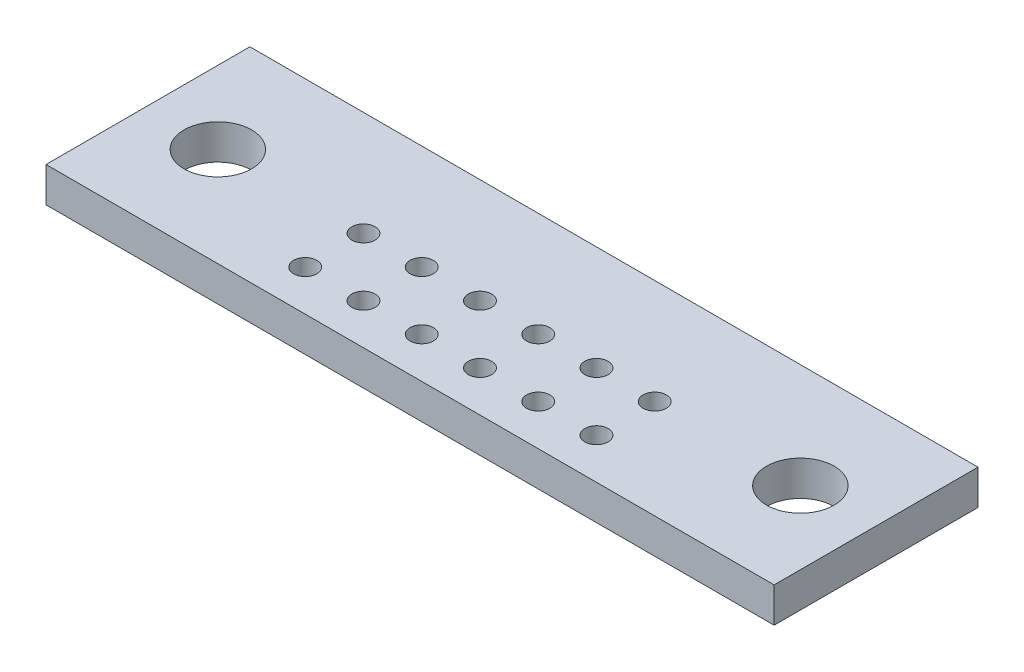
ISO-10303-21;
HEADER;
FILE_DESCRIPTION(('STEP AP214'),'2;1');
FILE_NAME('part.step','',(''),(''),'','','');
FILE_SCHEMA(('AUTOMOTIVE_DESIGN { 1 0 10303 214 1 1 1 1 }'));
ENDSEC;
DATA;
#1=APPLICATION_CONTEXT('core data for automotive mechanical design processes');
#2=APPLICATION_PROTOCOL_DEFINITION('international standard','automotive_design',2000,#1);
#3=PRODUCT_CONTEXT('',#1,'mechanical');
#4=PRODUCT('Part','Part','',(#3));
#5=PRODUCT_RELATED_PRODUCT_CATEGORY('part','',(#4));
#6=PRODUCT_DEFINITION_FORMATION('','',#4);
#7=PRODUCT_DEFINITION_CONTEXT('part definition',#1,'design');
#8=PRODUCT_DEFINITION('design','',#6,#7);
#9=PRODUCT_DEFINITION_SHAPE('','',#8);
#10=(LENGTH_UNIT() NAMED_UNIT(*) SI_UNIT(.MILLI.,.METRE.));
#11=(NAMED_UNIT(*) PLANE_ANGLE_UNIT() SI_UNIT($,.RADIAN.));
#12=(NAMED_UNIT(*) SI_UNIT($,.STERADIAN.) SOLID_ANGLE_UNIT());
#13=UNCERTAINTY_MEASURE_WITH_UNIT(LENGTH_MEASURE(1.E-05),#10,'distance_accuracy_value','');
#14=(GEOMETRIC_REPRESENTATION_CONTEXT(3) GLOBAL_UNCERTAINTY_ASSIGNED_CONTEXT((#13)) GLOBAL_UNIT_ASSIGNED_CONTEXT((#10,
#11,#12)) REPRESENTATION_CONTEXT('',''));
#15=CARTESIAN_POINT('',(0.,0.,0.));
#16=DIRECTION('',(0.,0.,1.));
#17=DIRECTION('',(1.,0.,0.));
#18=AXIS2_PLACEMENT_3D('',#15,#16,#17);
#19=CARTESIAN_POINT('',(0.,1.524,-8.89));
#20=DIRECTION('',(0.,-1.,0.));
#21=DIRECTION('',(0.,0.,-1.));
#22=AXIS2_PLACEMENT_3D('',#19,#20,#21);
#23=PLANE('',#22);
#24=CARTESIAN_POINT('',(28.575,1.524,-4.318));
#25=DIRECTION('',(0.,1.,0.));
#26=DIRECTION('',(0.,0.,1.));
#27=AXIS2_PLACEMENT_3D('',#24,#25,#26);
#28=CIRCLE('',#27,1.4732);
#29=CARTESIAN_POINT('',(28.575,1.524,-5.7912));
#30=VERTEX_POINT('',#29);
#31=EDGE_CURVE('E147',#30,#30,#28,.T.);
#32=ORIENTED_EDGE('',*,*,#31,.F.);
#33=EDGE_LOOP('',(#32));
#34=FACE_BOUND('',#33,.T.);
#35=CARTESIAN_POINT('',(19.685,1.524,-1.778));
#36=DIRECTION('',(0.,1.,0.));
#37=DIRECTION('',(0.,0.,-1.));
#38=AXIS2_PLACEMENT_3D('',#35,#36,#37);
#39=CIRCLE('',#38,0.508000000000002);
#40=CARTESIAN_POINT('',(19.685,1.524,-2.286));
#41=VERTEX_POINT('',#40);
#42=EDGE_CURVE('E161',#41,#41,#39,.T.);
#43=ORIENTED_EDGE('',*,*,#42,.F.);
#44=EDGE_LOOP('',(#43));
#45=FACE_BOUND('',#44,.T.);
#46=CARTESIAN_POINT('',(9.525,1.524,-1.778));
#47=DIRECTION('',(0.,1.,0.));
#48=DIRECTION('',(0.,0.,1.));
#49=AXIS2_PLACEMENT_3D('',#46,#47,#48);
#50=CIRCLE('',#49,0.508000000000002);
#51=CARTESIAN_POINT('',(9.525,1.524,-1.27));
#52=VERTEX_POINT('',#51);
#53=EDGE_CURVE('E171',#52,#52,#50,.T.);
#54=ORIENTED_EDGE('',*,*,#53,.F.);
#55=EDGE_LOOP('',(#54));
#56=FACE_BOUND('',#55,.T.);
#57=CARTESIAN_POINT('',(14.605,1.524,-1.778));
#58=DIRECTION('',(0.,1.,0.));
#59=DIRECTION('',(0.,0.,1.));
#60=AXIS2_PLACEMENT_3D('',#57,#58,#59);
#61=CIRCLE('',#60,0.508000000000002);
#62=CARTESIAN_POINT('',(14.605,1.524,-1.27));
#63=VERTEX_POINT('',#62);
#64=EDGE_CURVE('E181',#63,#63,#61,.T.);
#65=ORIENTED_EDGE('',*,*,#64,.F.);
#66=EDGE_LOOP('',(#65));
#67=FACE_BOUND('',#66,.T.);
#68=CARTESIAN_POINT('',(12.065,1.524,-4.318));
#69=DIRECTION('',(0.,1.,0.));
#70=DIRECTION('',(0.,0.,-1.));
#71=AXIS2_PLACEMENT_3D('',#68,#69,#70);
#72=CIRCLE('',#71,0.508000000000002);
#73=CARTESIAN_POINT('',(12.065,1.524,-4.826));
#74=VERTEX_POINT('',#73);
#75=EDGE_CURVE('E191',#74,#74,#72,.T.);
#76=ORIENTED_EDGE('',*,*,#75,.F.);
#77=EDGE_LOOP('',(#76));
#78=FACE_BOUND('',#77,.T.);
#79=CARTESIAN_POINT('',(22.225,1.524,-4.318));
#80=DIRECTION('',(0.,1.,0.));
#81=DIRECTION('',(0.,0.,1.));
#82=AXIS2_PLACEMENT_3D('',#79,#80,#81);
#83=CIRCLE('',#82,0.508000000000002);
#84=CARTESIAN_POINT('',(22.225,1.524,-3.81));
#85=VERTEX_POINT('',#84);
#86=EDGE_CURVE('E201',#85,#85,#83,.T.);
#87=ORIENTED_EDGE('',*,*,#86,.F.);
#88=EDGE_LOOP('',(#87));
#89=FACE_BOUND('',#88,.T.);
#90=CARTESIAN_POINT('',(17.145,1.524,-4.318));
#91=DIRECTION('',(0.,1.,0.));
#92=DIRECTION('',(0.,0.,1.));
#93=AXIS2_PLACEMENT_3D('',#90,#91,#92);
#94=CIRCLE('',#93,0.508000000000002);
#95=CARTESIAN_POINT('',(17.145,1.524,-3.81));
#96=VERTEX_POINT('',#95);
#97=EDGE_CURVE('E89',#96,#96,#94,.T.);
#98=ORIENTED_EDGE('',*,*,#97,.F.);
#99=EDGE_LOOP('',(#98));
#100=FACE_BOUND('',#99,.T.);
#101=DIRECTION('',(0.,0.,1.));
#102=VECTOR('',#101,1.);
#103=CARTESIAN_POINT('',(0.,1.524,0.));
#104=LINE('',#103,#102);
#105=CARTESIAN_POINT('',(0.,1.524,-8.89));
#106=VERTEX_POINT('',#105);
#107=CARTESIAN_POINT('',(0.,1.524,0.));
#108=VERTEX_POINT('',#107);
#109=EDGE_CURVE('E99',#106,#108,#104,.T.);
#110=ORIENTED_EDGE('',*,*,#109,.T.);
#111=DIRECTION('',(1.,0.,0.));
#112=VECTOR('',#111,1.);
#113=CARTESIAN_POINT('',(0.,1.524,0.));
#114=LINE('',#113,#112);
#115=CARTESIAN_POINT('',(31.75,1.524,0.));
#116=VERTEX_POINT('',#115);
#117=EDGE_CURVE('E84',#108,#116,#114,.T.);
#118=ORIENTED_EDGE('',*,*,#117,.T.);
#119=DIRECTION('',(0.,0.,-1.));
#120=VECTOR('',#119,1.);
#121=CARTESIAN_POINT('',(31.75,1.524,0.));
#122=LINE('',#121,#120);
#123=CARTESIAN_POINT('',(31.75,1.524,-8.89));
#124=VERTEX_POINT('',#123);
#125=EDGE_CURVE('E50',#116,#124,#122,.T.);
#126=ORIENTED_EDGE('',*,*,#125,.T.);
#127=DIRECTION('',(-1.,0.,0.));
#128=VECTOR('',#127,1.);
#129=CARTESIAN_POINT('',(0.,1.524,-8.89));
#130=LINE('',#129,#128);
#131=EDGE_CURVE('E45',#124,#106,#130,.T.);
#132=ORIENTED_EDGE('',*,*,#131,.T.);
#133=EDGE_LOOP('',(#110,#118,#126,#132));
#134=FACE_BOUND('',#133,.T.);
#135=CARTESIAN_POINT('',(19.685,1.524,-4.318));
#136=DIRECTION('',(0.,1.,0.));
#137=DIRECTION('',(0.,0.,1.));
#138=AXIS2_PLACEMENT_3D('',#135,#136,#137);
#139=CIRCLE('',#138,0.508000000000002);
#140=CARTESIAN_POINT('',(19.685,1.524,-3.81));
#141=VERTEX_POINT('',#140);
#142=EDGE_CURVE('E118',#141,#141,#139,.T.);
#143=ORIENTED_EDGE('',*,*,#142,.F.);
#144=EDGE_LOOP('',(#143));
#145=FACE_BOUND('',#144,.T.);
#146=CARTESIAN_POINT('',(9.525,1.524,-4.318));
#147=DIRECTION('',(0.,1.,0.));
#148=DIRECTION('',(0.,0.,-1.));
#149=AXIS2_PLACEMENT_3D('',#146,#147,#148);
#150=CIRCLE('',#149,0.508000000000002);
#151=CARTESIAN_POINT('',(9.525,1.524,-4.826));
#152=VERTEX_POINT('',#151);
#153=EDGE_CURVE('E122',#152,#152,#150,.T.);
#154=ORIENTED_EDGE('',*,*,#153,.F.);
#155=EDGE_LOOP('',(#154));
#156=FACE_BOUND('',#155,.T.);
#157=CARTESIAN_POINT('',(14.605,1.524,-4.318));
#158=DIRECTION('',(0.,1.,0.));
#159=DIRECTION('',(0.,0.,-1.));
#160=AXIS2_PLACEMENT_3D('',#157,#158,#159);
#161=CIRCLE('',#160,0.508000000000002);
#162=CARTESIAN_POINT('',(14.605,1.524,-4.826));
#163=VERTEX_POINT('',#162);
#164=EDGE_CURVE('E126',#163,#163,#161,.T.);
#165=ORIENTED_EDGE('',*,*,#164,.F.);
#166=EDGE_LOOP('',(#165));
#167=FACE_BOUND('',#166,.T.);
#168=CARTESIAN_POINT('',(12.065,1.524,-1.778));
#169=DIRECTION('',(0.,1.,0.));
#170=DIRECTION('',(0.,0.,1.));
#171=AXIS2_PLACEMENT_3D('',#168,#169,#170);
#172=CIRCLE('',#171,0.508000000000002);
#173=CARTESIAN_POINT('',(12.065,1.524,-1.27));
#174=VERTEX_POINT('',#173);
#175=EDGE_CURVE('E130',#174,#174,#172,.T.);
#176=ORIENTED_EDGE('',*,*,#175,.F.);
#177=EDGE_LOOP('',(#176));
#178=FACE_BOUND('',#177,.T.);
#179=CARTESIAN_POINT('',(22.225,1.524,-1.778));
#180=DIRECTION('',(0.,1.,0.));
#181=DIRECTION('',(0.,0.,-1.));
#182=AXIS2_PLACEMENT_3D('',#179,#180,#181);
#183=CIRCLE('',#182,0.508000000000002);
#184=CARTESIAN_POINT('',(22.225,1.524,-2.286));
#185=VERTEX_POINT('',#184);
#186=EDGE_CURVE('E134',#185,#185,#183,.T.);
#187=ORIENTED_EDGE('',*,*,#186,.F.);
#188=EDGE_LOOP('',(#187));
#189=FACE_BOUND('',#188,.T.);
#190=CARTESIAN_POINT('',(17.145,1.524,-1.778));
#191=DIRECTION('',(0.,1.,0.));
#192=DIRECTION('',(0.,0.,-1.));
#193=AXIS2_PLACEMENT_3D('',#190,#191,#192);
#194=CIRCLE('',#193,0.508000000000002);
#195=CARTESIAN_POINT('',(17.145,1.524,-2.286));
#196=VERTEX_POINT('',#195);
#197=EDGE_CURVE('E138',#196,#196,#194,.T.);
#198=ORIENTED_EDGE('',*,*,#197,.F.);
#199=EDGE_LOOP('',(#198));
#200=FACE_BOUND('',#199,.T.);
#201=CARTESIAN_POINT('',(3.175,1.524,-4.318));
#202=DIRECTION('',(0.,1.,0.));
#203=DIRECTION('',(0.,0.,1.));
#204=AXIS2_PLACEMENT_3D('',#201,#202,#203);
#205=CIRCLE('',#204,1.4732);
#206=CARTESIAN_POINT('',(3.175,1.524,-5.7912));
#207=VERTEX_POINT('',#206);
#208=EDGE_CURVE('E141',#207,#207,#205,.T.);
#209=ORIENTED_EDGE('',*,*,#208,.F.);
#210=EDGE_LOOP('',(#209));
#211=FACE_BOUND('',#210,.T.);
#212=ADVANCED_FACE('F30',(#34,#45,#56,#67,#78,#89,#100,#134,#145,#156,#167,#178,#189,#200,#211),
#23,.F.);
#213=CARTESIAN_POINT('',(0.,0.,-8.89));
#214=DIRECTION('',(0.,-1.,0.));
#215=DIRECTION('',(0.,0.,-1.));
#216=AXIS2_PLACEMENT_3D('',#213,#214,#215);
#217=PLANE('',#216);
#218=CARTESIAN_POINT('',(28.575,0.,-4.318));
#219=DIRECTION('',(0.,1.,0.));
#220=DIRECTION('',(0.,0.,1.));
#221=AXIS2_PLACEMENT_3D('',#218,#219,#220);
#222=CIRCLE('',#221,1.4732);
#223=CARTESIAN_POINT('',(28.575,0.,-5.7912));
#224=VERTEX_POINT('',#223);
#225=EDGE_CURVE('E143',#224,#224,#222,.T.);
#226=ORIENTED_EDGE('',*,*,#225,.T.);
#227=EDGE_LOOP('',(#226));
#228=FACE_BOUND('',#227,.T.);
#229=CARTESIAN_POINT('',(19.685,0.,-1.778));
#230=DIRECTION('',(0.,1.,0.));
#231=DIRECTION('',(0.,0.,-1.));
#232=AXIS2_PLACEMENT_3D('',#229,#230,#231);
#233=CIRCLE('',#232,0.508000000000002);
#234=CARTESIAN_POINT('',(19.685,0.,-2.286));
#235=VERTEX_POINT('',#234);
#236=EDGE_CURVE('E158',#235,#235,#233,.T.);
#237=ORIENTED_EDGE('',*,*,#236,.T.);
#238=EDGE_LOOP('',(#237));
#239=FACE_BOUND('',#238,.T.);
#240=CARTESIAN_POINT('',(9.525,0.,-1.778));
#241=DIRECTION('',(0.,1.,0.));
#242=DIRECTION('',(0.,0.,1.));
#243=AXIS2_PLACEMENT_3D('',#240,#241,#242);
#244=CIRCLE('',#243,0.508000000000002);
#245=CARTESIAN_POINT('',(9.525,0.,-1.27));
#246=VERTEX_POINT('',#245);
#247=EDGE_CURVE('E168',#246,#246,#244,.T.);
#248=ORIENTED_EDGE('',*,*,#247,.T.);
#249=EDGE_LOOP('',(#248));
#250=FACE_BOUND('',#249,.T.);
#251=CARTESIAN_POINT('',(14.605,0.,-1.778));
#252=DIRECTION('',(0.,1.,0.));
#253=DIRECTION('',(0.,0.,1.));
#254=AXIS2_PLACEMENT_3D('',#251,#252,#253);
#255=CIRCLE('',#254,0.508000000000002);
#256=CARTESIAN_POINT('',(14.605,0.,-1.27));
#257=VERTEX_POINT('',#256);
#258=EDGE_CURVE('E178',#257,#257,#255,.T.);
#259=ORIENTED_EDGE('',*,*,#258,.T.);
#260=EDGE_LOOP('',(#259));
#261=FACE_BOUND('',#260,.T.);
#262=CARTESIAN_POINT('',(12.065,0.,-4.318));
#263=DIRECTION('',(0.,1.,0.));
#264=DIRECTION('',(0.,0.,-1.));
#265=AXIS2_PLACEMENT_3D('',#262,#263,#264);
#266=CIRCLE('',#265,0.508000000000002);
#267=CARTESIAN_POINT('',(12.065,0.,-4.826));
#268=VERTEX_POINT('',#267);
#269=EDGE_CURVE('E188',#268,#268,#266,.T.);
#270=ORIENTED_EDGE('',*,*,#269,.T.);
#271=EDGE_LOOP('',(#270));
#272=FACE_BOUND('',#271,.T.);
#273=CARTESIAN_POINT('',(22.225,0.,-4.318));
#274=DIRECTION('',(0.,1.,0.));
#275=DIRECTION('',(0.,0.,1.));
#276=AXIS2_PLACEMENT_3D('',#273,#274,#275);
#277=CIRCLE('',#276,0.508000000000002);
#278=CARTESIAN_POINT('',(22.225,0.,-3.81));
#279=VERTEX_POINT('',#278);
#280=EDGE_CURVE('E198',#279,#279,#277,.T.);
#281=ORIENTED_EDGE('',*,*,#280,.T.);
#282=EDGE_LOOP('',(#281));
#283=FACE_BOUND('',#282,.T.);
#284=CARTESIAN_POINT('',(17.145,0.,-4.318));
#285=DIRECTION('',(0.,1.,0.));
#286=DIRECTION('',(0.,0.,1.));
#287=AXIS2_PLACEMENT_3D('',#284,#285,#286);
#288=CIRCLE('',#287,0.508000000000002);
#289=CARTESIAN_POINT('',(17.145,0.,-3.81));
#290=VERTEX_POINT('',#289);
#291=EDGE_CURVE('E92',#290,#290,#288,.T.);
#292=ORIENTED_EDGE('',*,*,#291,.T.);
#293=EDGE_LOOP('',(#292));
#294=FACE_BOUND('',#293,.T.);
#295=DIRECTION('',(0.,0.,1.));
#296=VECTOR('',#295,1.);
#297=CARTESIAN_POINT('',(0.,0.,0.));
#298=LINE('',#297,#296);
#299=CARTESIAN_POINT('',(0.,0.,-8.89));
#300=VERTEX_POINT('',#299);
#301=CARTESIAN_POINT('',(0.,0.,0.));
#302=VERTEX_POINT('',#301);
#303=EDGE_CURVE('E76',#300,#302,#298,.T.);
#304=ORIENTED_EDGE('',*,*,#303,.F.);
#305=DIRECTION('',(-1.,0.,0.));
#306=VECTOR('',#305,1.);
#307=CARTESIAN_POINT('',(0.,0.,-8.89));
#308=LINE('',#307,#306);
#309=CARTESIAN_POINT('',(31.75,0.,-8.89));
#310=VERTEX_POINT('',#309);
#311=EDGE_CURVE('E97',#310,#300,#308,.T.);
#312=ORIENTED_EDGE('',*,*,#311,.F.);
#313=DIRECTION('',(0.,0.,-1.));
#314=VECTOR('',#313,1.);
#315=CARTESIAN_POINT('',(31.75,0.,0.));
#316=LINE('',#315,#314);
#317=CARTESIAN_POINT('',(31.75,0.,0.));
#318=VERTEX_POINT('',#317);
#319=EDGE_CURVE('E77',#318,#310,#316,.T.);
#320=ORIENTED_EDGE('',*,*,#319,.F.);
#321=DIRECTION('',(1.,0.,0.));
#322=VECTOR('',#321,1.);
#323=CARTESIAN_POINT('',(0.,0.,0.));
#324=LINE('',#323,#322);
#325=EDGE_CURVE('E71',#302,#318,#324,.T.);
#326=ORIENTED_EDGE('',*,*,#325,.F.);
#327=EDGE_LOOP('',(#304,#312,#320,#326));
#328=FACE_BOUND('',#327,.T.);
#329=CARTESIAN_POINT('',(19.685,0.,-4.318));
#330=DIRECTION('',(0.,1.,0.));
#331=DIRECTION('',(0.,0.,1.));
#332=AXIS2_PLACEMENT_3D('',#329,#330,#331);
#333=CIRCLE('',#332,0.508000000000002);
#334=CARTESIAN_POINT('',(19.685,0.,-3.81));
#335=VERTEX_POINT('',#334);
#336=EDGE_CURVE('E204',#335,#335,#333,.T.);
#337=ORIENTED_EDGE('',*,*,#336,.T.);
#338=EDGE_LOOP('',(#337));
#339=FACE_BOUND('',#338,.T.);
#340=CARTESIAN_POINT('',(9.525,0.,-4.318));
#341=DIRECTION('',(0.,1.,0.));
#342=DIRECTION('',(0.,0.,-1.));
#343=AXIS2_PLACEMENT_3D('',#340,#341,#342);
#344=CIRCLE('',#343,0.508000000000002);
#345=CARTESIAN_POINT('',(9.525,0.,-4.826));
#346=VERTEX_POINT('',#345);
#347=EDGE_CURVE('E194',#346,#346,#344,.T.);
#348=ORIENTED_EDGE('',*,*,#347,.T.);
#349=EDGE_LOOP('',(#348));
#350=FACE_BOUND('',#349,.T.);
#351=CARTESIAN_POINT('',(14.605,0.,-4.318));
#352=DIRECTION('',(0.,1.,0.));
#353=DIRECTION('',(0.,0.,-1.));
#354=AXIS2_PLACEMENT_3D('',#351,#352,#353);
#355=CIRCLE('',#354,0.508000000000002);
#356=CARTESIAN_POINT('',(14.605,0.,-4.826));
#357=VERTEX_POINT('',#356);
#358=EDGE_CURVE('E184',#357,#357,#355,.T.);
#359=ORIENTED_EDGE('',*,*,#358,.T.);
#360=EDGE_LOOP('',(#359));
#361=FACE_BOUND('',#360,.T.);
#362=CARTESIAN_POINT('',(12.065,0.,-1.778));
#363=DIRECTION('',(0.,1.,0.));
#364=DIRECTION('',(0.,0.,1.));
#365=AXIS2_PLACEMENT_3D('',#362,#363,#364);
#366=CIRCLE('',#365,0.508000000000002);
#367=CARTESIAN_POINT('',(12.065,0.,-1.27));
#368=VERTEX_POINT('',#367);
#369=EDGE_CURVE('E174',#368,#368,#366,.T.);
#370=ORIENTED_EDGE('',*,*,#369,.T.);
#371=EDGE_LOOP('',(#370));
#372=FACE_BOUND('',#371,.T.);
#373=CARTESIAN_POINT('',(22.225,0.,-1.778));
#374=DIRECTION('',(0.,1.,0.));
#375=DIRECTION('',(0.,0.,-1.));
#376=AXIS2_PLACEMENT_3D('',#373,#374,#375);
#377=CIRCLE('',#376,0.508000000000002);
#378=CARTESIAN_POINT('',(22.225,0.,-2.286));
#379=VERTEX_POINT('',#378);
#380=EDGE_CURVE('E164',#379,#379,#377,.T.);
#381=ORIENTED_EDGE('',*,*,#380,.T.);
#382=EDGE_LOOP('',(#381));
#383=FACE_BOUND('',#382,.T.);
#384=CARTESIAN_POINT('',(17.145,0.,-1.778));
#385=DIRECTION('',(0.,1.,0.));
#386=DIRECTION('',(0.,0.,-1.));
#387=AXIS2_PLACEMENT_3D('',#384,#385,#386);
#388=CIRCLE('',#387,0.508000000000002);
#389=CARTESIAN_POINT('',(17.145,0.,-2.286));
#390=VERTEX_POINT('',#389);
#391=EDGE_CURVE('E154',#390,#390,#388,.T.);
#392=ORIENTED_EDGE('',*,*,#391,.T.);
#393=EDGE_LOOP('',(#392));
#394=FACE_BOUND('',#393,.T.);
#395=CARTESIAN_POINT('',(3.175,0.,-4.318));
#396=DIRECTION('',(0.,1.,0.));
#397=DIRECTION('',(0.,0.,1.));
#398=AXIS2_PLACEMENT_3D('',#395,#396,#397);
#399=CIRCLE('',#398,1.4732);
#400=CARTESIAN_POINT('',(3.175,0.,-5.7912));
#401=VERTEX_POINT('',#400);
#402=EDGE_CURVE('E144',#401,#401,#399,.T.);
#403=ORIENTED_EDGE('',*,*,#402,.T.);
#404=EDGE_LOOP('',(#403));
#405=FACE_BOUND('',#404,.T.);
#406=ADVANCED_FACE('F72',(#228,#239,#250,#261,#272,#283,#294,#328,#339,#350,#361,#372,#383,#394,
#405),#217,.T.);
#407=CARTESIAN_POINT('',(0.,1.524,0.));
#408=DIRECTION('',(1.,0.,0.));
#409=DIRECTION('',(0.,0.,-1.));
#410=AXIS2_PLACEMENT_3D('',#407,#408,#409);
#411=PLANE('',#410);
#412=ORIENTED_EDGE('',*,*,#303,.T.);
#413=DIRECTION('',(0.,-1.,0.));
#414=VECTOR('',#413,1.);
#415=CARTESIAN_POINT('',(0.,1.524,0.));
#416=LINE('',#415,#414);
#417=EDGE_CURVE('E11',#108,#302,#416,.T.);
#418=ORIENTED_EDGE('',*,*,#417,.F.);
#419=ORIENTED_EDGE('',*,*,#109,.F.);
#420=DIRECTION('',(0.,-1.,0.));
#421=VECTOR('',#420,1.);
#422=CARTESIAN_POINT('',(0.,1.524,-8.89));
#423=LINE('',#422,#421);
#424=EDGE_CURVE('E88',#106,#300,#423,.T.);
#425=ORIENTED_EDGE('',*,*,#424,.T.);
#426=EDGE_LOOP('',(#412,#418,#419,#425));
#427=FACE_BOUND('',#426,.T.);
#428=ADVANCED_FACE('F32',(#427),#411,.F.);
#429=CARTESIAN_POINT('',(0.,1.524,0.));
#430=DIRECTION('',(0.,0.,-1.));
#431=DIRECTION('',(-1.,0.,0.));
#432=AXIS2_PLACEMENT_3D('',#429,#430,#431);
#433=PLANE('',#432);
#434=ORIENTED_EDGE('',*,*,#325,.T.);
#435=DIRECTION('',(0.,-1.,0.));
#436=VECTOR('',#435,1.);
#437=CARTESIAN_POINT('',(31.75,1.524,0.));
#438=LINE('',#437,#436);
#439=EDGE_CURVE('E38',#116,#318,#438,.T.);
#440=ORIENTED_EDGE('',*,*,#439,.F.);
#441=ORIENTED_EDGE('',*,*,#117,.F.);
#442=ORIENTED_EDGE('',*,*,#417,.T.);
#443=EDGE_LOOP('',(#434,#440,#441,#442));
#444=FACE_BOUND('',#443,.T.);
#445=ADVANCED_FACE('F83',(#444),#433,.F.);
#446=CARTESIAN_POINT('',(31.75,1.524,0.));
#447=DIRECTION('',(-1.,0.,0.));
#448=DIRECTION('',(0.,0.,1.));
#449=AXIS2_PLACEMENT_3D('',#446,#447,#448);
#450=PLANE('',#449);
#451=ORIENTED_EDGE('',*,*,#319,.T.);
#452=DIRECTION('',(0.,-1.,0.));
#453=VECTOR('',#452,1.);
#454=CARTESIAN_POINT('',(31.75,1.524,-8.89));
#455=LINE('',#454,#453);
#456=EDGE_CURVE('E105',#124,#310,#455,.T.);
#457=ORIENTED_EDGE('',*,*,#456,.F.);
#458=ORIENTED_EDGE('',*,*,#125,.F.);
#459=ORIENTED_EDGE('',*,*,#439,.T.);
#460=EDGE_LOOP('',(#451,#457,#458,#459));
#461=FACE_BOUND('',#460,.T.);
#462=ADVANCED_FACE('F108',(#461),#450,.F.);
#463=CARTESIAN_POINT('',(0.,1.524,-8.89));
#464=DIRECTION('',(0.,0.,1.));
#465=DIRECTION('',(1.,0.,0.));
#466=AXIS2_PLACEMENT_3D('',#463,#464,#465);
#467=PLANE('',#466);
#468=ORIENTED_EDGE('',*,*,#311,.T.);
#469=ORIENTED_EDGE('',*,*,#424,.F.);
#470=ORIENTED_EDGE('',*,*,#131,.F.);
#471=ORIENTED_EDGE('',*,*,#456,.T.);
#472=EDGE_LOOP('',(#468,#469,#470,#471));
#473=FACE_BOUND('',#472,.T.);
#474=ADVANCED_FACE('F110',(#473),#467,.F.);
#475=CARTESIAN_POINT('',(17.145,1.524,-4.318));
#476=DIRECTION('',(0.,-1.,0.));
#477=DIRECTION('',(0.,0.,-1.));
#478=AXIS2_PLACEMENT_3D('',#475,#476,#477);
#479=CYLINDRICAL_SURFACE('',#478,0.508000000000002);
#480=ORIENTED_EDGE('',*,*,#97,.T.);
#481=EDGE_LOOP('',(#480));
#482=FACE_BOUND('',#481,.T.);
#483=ORIENTED_EDGE('',*,*,#291,.F.);
#484=EDGE_LOOP('',(#483));
#485=FACE_BOUND('',#484,.T.);
#486=ADVANCED_FACE('F211',(#482,#485),#479,.F.);
#487=CARTESIAN_POINT('',(19.685,1.524,-4.318));
#488=DIRECTION('',(0.,-1.,0.));
#489=DIRECTION('',(0.,0.,-1.));
#490=AXIS2_PLACEMENT_3D('',#487,#488,#489);
#491=CYLINDRICAL_SURFACE('',#490,0.508000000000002);
#492=ORIENTED_EDGE('',*,*,#142,.T.);
#493=EDGE_LOOP('',(#492));
#494=FACE_BOUND('',#493,.T.);
#495=ORIENTED_EDGE('',*,*,#336,.F.);
#496=EDGE_LOOP('',(#495));
#497=FACE_BOUND('',#496,.T.);
#498=ADVANCED_FACE('F213',(#494,#497),#491,.F.);
#499=CARTESIAN_POINT('',(22.225,1.524,-4.318));
#500=DIRECTION('',(0.,-1.,0.));
#501=DIRECTION('',(0.,0.,-1.));
#502=AXIS2_PLACEMENT_3D('',#499,#500,#501);
#503=CYLINDRICAL_SURFACE('',#502,0.508000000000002);
#504=ORIENTED_EDGE('',*,*,#86,.T.);
#505=EDGE_LOOP('',(#504));
#506=FACE_BOUND('',#505,.T.);
#507=ORIENTED_EDGE('',*,*,#280,.F.);
#508=EDGE_LOOP('',(#507));
#509=FACE_BOUND('',#508,.T.);
#510=ADVANCED_FACE('F220',(#506,#509),#503,.F.);
#511=CARTESIAN_POINT('',(9.525,1.524,-4.318));
#512=DIRECTION('',(0.,-1.,0.));
#513=DIRECTION('',(0.,0.,-1.));
#514=AXIS2_PLACEMENT_3D('',#511,#512,#513);
#515=CYLINDRICAL_SURFACE('',#514,0.508000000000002);
#516=ORIENTED_EDGE('',*,*,#153,.T.);
#517=EDGE_LOOP('',(#516));
#518=FACE_BOUND('',#517,.T.);
#519=ORIENTED_EDGE('',*,*,#347,.F.);
#520=EDGE_LOOP('',(#519));
#521=FACE_BOUND('',#520,.T.);
#522=ADVANCED_FACE('F281',(#518,#521),#515,.F.);
#523=CARTESIAN_POINT('',(12.065,1.524,-4.318));
#524=DIRECTION('',(0.,-1.,0.));
#525=DIRECTION('',(0.,0.,-1.));
#526=AXIS2_PLACEMENT_3D('',#523,#524,#525);
#527=CYLINDRICAL_SURFACE('',#526,0.508000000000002);
#528=ORIENTED_EDGE('',*,*,#75,.T.);
#529=EDGE_LOOP('',(#528));
#530=FACE_BOUND('',#529,.T.);
#531=ORIENTED_EDGE('',*,*,#269,.F.);
#532=EDGE_LOOP('',(#531));
#533=FACE_BOUND('',#532,.T.);
#534=ADVANCED_FACE('F289',(#530,#533),#527,.F.);
#535=CARTESIAN_POINT('',(14.605,1.524,-4.318));
#536=DIRECTION('',(0.,-1.,0.));
#537=DIRECTION('',(0.,0.,-1.));
#538=AXIS2_PLACEMENT_3D('',#535,#536,#537);
#539=CYLINDRICAL_SURFACE('',#538,0.508000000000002);
#540=ORIENTED_EDGE('',*,*,#164,.T.);
#541=EDGE_LOOP('',(#540));
#542=FACE_BOUND('',#541,.T.);
#543=ORIENTED_EDGE('',*,*,#358,.F.);
#544=EDGE_LOOP('',(#543));
#545=FACE_BOUND('',#544,.T.);
#546=ADVANCED_FACE('F298',(#542,#545),#539,.F.);
#547=CARTESIAN_POINT('',(14.605,1.524,-1.778));
#548=DIRECTION('',(0.,-1.,0.));
#549=DIRECTION('',(0.,0.,-1.));
#550=AXIS2_PLACEMENT_3D('',#547,#548,#549);
#551=CYLINDRICAL_SURFACE('',#550,0.508000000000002);
#552=ORIENTED_EDGE('',*,*,#64,.T.);
#553=EDGE_LOOP('',(#552));
#554=FACE_BOUND('',#553,.T.);
#555=ORIENTED_EDGE('',*,*,#258,.F.);
#556=EDGE_LOOP('',(#555));
#557=FACE_BOUND('',#556,.T.);
#558=ADVANCED_FACE('F307',(#554,#557),#551,.F.);
#559=CARTESIAN_POINT('',(12.065,1.524,-1.778));
#560=DIRECTION('',(0.,-1.,0.));
#561=DIRECTION('',(0.,0.,-1.));
#562=AXIS2_PLACEMENT_3D('',#559,#560,#561);
#563=CYLINDRICAL_SURFACE('',#562,0.508000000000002);
#564=ORIENTED_EDGE('',*,*,#175,.T.);
#565=EDGE_LOOP('',(#564));
#566=FACE_BOUND('',#565,.T.);
#567=ORIENTED_EDGE('',*,*,#369,.F.);
#568=EDGE_LOOP('',(#567));
#569=FACE_BOUND('',#568,.T.);
#570=ADVANCED_FACE('F316',(#566,#569),#563,.F.);
#571=CARTESIAN_POINT('',(9.525,1.524,-1.778));
#572=DIRECTION('',(0.,-1.,0.));
#573=DIRECTION('',(0.,0.,-1.));
#574=AXIS2_PLACEMENT_3D('',#571,#572,#573);
#575=CYLINDRICAL_SURFACE('',#574,0.508000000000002);
#576=ORIENTED_EDGE('',*,*,#53,.T.);
#577=EDGE_LOOP('',(#576));
#578=FACE_BOUND('',#577,.T.);
#579=ORIENTED_EDGE('',*,*,#247,.F.);
#580=EDGE_LOOP('',(#579));
#581=FACE_BOUND('',#580,.T.);
#582=ADVANCED_FACE('F325',(#578,#581),#575,.F.);
#583=CARTESIAN_POINT('',(22.225,1.524,-1.778));
#584=DIRECTION('',(0.,-1.,0.));
#585=DIRECTION('',(0.,0.,-1.));
#586=AXIS2_PLACEMENT_3D('',#583,#584,#585);
#587=CYLINDRICAL_SURFACE('',#586,0.508000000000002);
#588=ORIENTED_EDGE('',*,*,#186,.T.);
#589=EDGE_LOOP('',(#588));
#590=FACE_BOUND('',#589,.T.);
#591=ORIENTED_EDGE('',*,*,#380,.F.);
#592=EDGE_LOOP('',(#591));
#593=FACE_BOUND('',#592,.T.);
#594=ADVANCED_FACE('F334',(#590,#593),#587,.F.);
#595=CARTESIAN_POINT('',(19.685,1.524,-1.778));
#596=DIRECTION('',(0.,-1.,0.));
#597=DIRECTION('',(0.,0.,-1.));
#598=AXIS2_PLACEMENT_3D('',#595,#596,#597);
#599=CYLINDRICAL_SURFACE('',#598,0.508000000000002);
#600=ORIENTED_EDGE('',*,*,#42,.T.);
#601=EDGE_LOOP('',(#600));
#602=FACE_BOUND('',#601,.T.);
#603=ORIENTED_EDGE('',*,*,#236,.F.);
#604=EDGE_LOOP('',(#603));
#605=FACE_BOUND('',#604,.T.);
#606=ADVANCED_FACE('F343',(#602,#605),#599,.F.);
#607=CARTESIAN_POINT('',(17.145,1.524,-1.778));
#608=DIRECTION('',(0.,-1.,0.));
#609=DIRECTION('',(0.,0.,-1.));
#610=AXIS2_PLACEMENT_3D('',#607,#608,#609);
#611=CYLINDRICAL_SURFACE('',#610,0.508000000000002);
#612=ORIENTED_EDGE('',*,*,#197,.T.);
#613=EDGE_LOOP('',(#612));
#614=FACE_BOUND('',#613,.T.);
#615=ORIENTED_EDGE('',*,*,#391,.F.);
#616=EDGE_LOOP('',(#615));
#617=FACE_BOUND('',#616,.T.);
#618=ADVANCED_FACE('F352',(#614,#617),#611,.F.);
#619=CARTESIAN_POINT('',(28.575,1.524,-4.318));
#620=DIRECTION('',(0.,-1.,0.));
#621=DIRECTION('',(0.,0.,-1.));
#622=AXIS2_PLACEMENT_3D('',#619,#620,#621);
#623=CYLINDRICAL_SURFACE('',#622,1.4732);
#624=CARTESIAN_POINT('',(28.575,1.524,-5.7912));
#625=CARTESIAN_POINT('',(28.575,1.508125,-5.7912));
#626=CARTESIAN_POINT('',(28.575,1.49225,-5.7912));
#627=CARTESIAN_POINT('',(28.575,1.4605,-5.7912));
#628=CARTESIAN_POINT('',(28.575,1.444625,-5.7912));
#629=CARTESIAN_POINT('',(28.575,1.412875,-5.7912));
#630=CARTESIAN_POINT('',(28.575,1.397,-5.7912));
#631=CARTESIAN_POINT('',(28.575,1.36525,-5.7912));
#632=CARTESIAN_POINT('',(28.575,1.349375,-5.7912));
#633=CARTESIAN_POINT('',(28.575,1.317625,-5.7912));
#634=CARTESIAN_POINT('',(28.575,1.30175,-5.7912));
#635=CARTESIAN_POINT('',(28.575,1.27,-5.7912));
#636=CARTESIAN_POINT('',(28.575,1.254125,-5.7912));
#637=CARTESIAN_POINT('',(28.575,1.222375,-5.7912));
#638=CARTESIAN_POINT('',(28.575,1.2065,-5.7912));
#639=CARTESIAN_POINT('',(28.575,1.17475,-5.7912));
#640=CARTESIAN_POINT('',(28.575,1.158875,-5.7912));
#641=CARTESIAN_POINT('',(28.575,1.127125,-5.7912));
#642=CARTESIAN_POINT('',(28.575,1.11125,-5.7912));
#643=CARTESIAN_POINT('',(28.575,1.0795,-5.7912));
#644=CARTESIAN_POINT('',(28.575,1.063625,-5.7912));
#645=CARTESIAN_POINT('',(28.575,1.031875,-5.7912));
#646=CARTESIAN_POINT('',(28.575,1.016,-5.7912));
#647=CARTESIAN_POINT('',(28.575,0.98425,-5.7912));
#648=CARTESIAN_POINT('',(28.575,0.968375,-5.7912));
#649=CARTESIAN_POINT('',(28.575,0.936625,-5.7912));
#650=CARTESIAN_POINT('',(28.575,0.92075,-5.7912));
#651=CARTESIAN_POINT('',(28.575,0.889,-5.7912));
#652=CARTESIAN_POINT('',(28.575,0.873125,-5.7912));
#653=CARTESIAN_POINT('',(28.575,0.841375,-5.7912));
#654=CARTESIAN_POINT('',(28.575,0.8255,-5.7912));
#655=CARTESIAN_POINT('',(28.575,0.79375,-5.7912));
#656=CARTESIAN_POINT('',(28.575,0.777875,-5.7912));
#657=CARTESIAN_POINT('',(28.575,0.746125,-5.7912));
#658=CARTESIAN_POINT('',(28.575,0.73025,-5.7912));
#659=CARTESIAN_POINT('',(28.575,0.6985,-5.7912));
#660=CARTESIAN_POINT('',(28.575,0.682625,-5.7912));
#661=CARTESIAN_POINT('',(28.575,0.650875,-5.7912));
#662=CARTESIAN_POINT('',(28.575,0.635,-5.7912));
#663=CARTESIAN_POINT('',(28.575,0.60325,-5.7912));
#664=CARTESIAN_POINT('',(28.575,0.587375,-5.7912));
#665=CARTESIAN_POINT('',(28.575,0.555625,-5.7912));
#666=CARTESIAN_POINT('',(28.575,0.53975,-5.7912));
#667=CARTESIAN_POINT('',(28.575,0.508,-5.7912));
#668=CARTESIAN_POINT('',(28.575,0.492125,-5.7912));
#669=CARTESIAN_POINT('',(28.575,0.460375,-5.7912));
#670=CARTESIAN_POINT('',(28.575,0.4445,-5.7912));
#671=CARTESIAN_POINT('',(28.575,0.41275,-5.7912));
#672=CARTESIAN_POINT('',(28.575,0.396875,-5.7912));
#673=CARTESIAN_POINT('',(28.575,0.365125,-5.7912));
#674=CARTESIAN_POINT('',(28.575,0.34925,-5.7912));
#675=CARTESIAN_POINT('',(28.575,0.3175,-5.7912));
#676=CARTESIAN_POINT('',(28.575,0.301625,-5.7912));
#677=CARTESIAN_POINT('',(28.575,0.269875,-5.7912));
#678=CARTESIAN_POINT('',(28.575,0.254,-5.7912));
#679=CARTESIAN_POINT('',(28.575,0.22225,-5.7912));
#680=CARTESIAN_POINT('',(28.575,0.206375,-5.7912));
#681=CARTESIAN_POINT('',(28.575,0.174625,-5.7912));
#682=CARTESIAN_POINT('',(28.575,0.15875,-5.7912));
#683=CARTESIAN_POINT('',(28.575,0.127,-5.7912));
#684=CARTESIAN_POINT('',(28.575,0.111125,-5.7912));
#685=CARTESIAN_POINT('',(28.575,0.079375,-5.7912));
#686=CARTESIAN_POINT('',(28.575,0.0635,-5.7912));
#687=CARTESIAN_POINT('',(28.575,0.0317499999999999,-5.7912));
#688=CARTESIAN_POINT('',(28.575,0.015875,-5.7912));
#689=CARTESIAN_POINT('',(28.575,0.,-5.7912));
#690=B_SPLINE_CURVE_WITH_KNOTS('',3,(#624,#625,#626,#627,#628,#629,#630,#631,#632,#633,#634,
#635,#636,#637,#638,#639,#640,#641,#642,#643,#644,#645,#646,#647,#648,#649,#650,#651,#652,#653,
#654,#655,#656,#657,#658,#659,#660,#661,#662,#663,#664,#665,#666,#667,#668,#669,#670,#671,#672,
#673,#674,#675,#676,#677,#678,#679,#680,#681,#682,#683,#684,#685,#686,#687,#688,#689),
.UNSPECIFIED.,.F.,.F.,(4,2,2,2,2,2,2,2,2,2,2,2,2,2,2,2,2,2,2,2,2,2,2,2,2,2,2,2,2,2,2,2,4),(0.,
0.0476250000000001,0.0952500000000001,0.142875,0.1905,0.238125,0.28575,0.333375,0.381,0.428625,
0.47625,0.523875,0.5715,0.619125,0.66675,0.714375,0.762,0.809625,0.85725,0.904875,0.9525,
1.000125,1.04775,1.095375,1.143,1.190625,1.23825,1.285875,1.3335,1.381125,1.42875,1.476375,
1.524),.UNSPECIFIED.);
#691=EDGE_CURVE('BSEAM361',#30,#224,#690,.T.);
#692=ORIENTED_EDGE('',*,*,#31,.T.);
#693=ORIENTED_EDGE('',*,*,#225,.F.);
#694=ORIENTED_EDGE('',*,*,#691,.T.);
#695=ORIENTED_EDGE('',*,*,#691,.F.);
#696=EDGE_LOOP('',(#692,#694,#693,#695));
#697=FACE_BOUND('',#696,.T.);
#698=ADVANCED_FACE('F361',(#697),#623,.F.);
#699=CARTESIAN_POINT('',(3.175,1.524,-4.318));
#700=DIRECTION('',(0.,-1.,0.));
#701=DIRECTION('',(0.,0.,-1.));
#702=AXIS2_PLACEMENT_3D('',#699,#700,#701);
#703=CYLINDRICAL_SURFACE('',#702,1.4732);
#704=CARTESIAN_POINT('',(3.175,1.524,-5.7912));
#705=CARTESIAN_POINT('',(3.175,1.508125,-5.7912));
#706=CARTESIAN_POINT('',(3.175,1.49225,-5.7912));
#707=CARTESIAN_POINT('',(3.175,1.4605,-5.7912));
#708=CARTESIAN_POINT('',(3.175,1.444625,-5.7912));
#709=CARTESIAN_POINT('',(3.175,1.412875,-5.7912));
#710=CARTESIAN_POINT('',(3.175,1.397,-5.7912));
#711=CARTESIAN_POINT('',(3.175,1.36525,-5.7912));
#712=CARTESIAN_POINT('',(3.175,1.349375,-5.7912));
#713=CARTESIAN_POINT('',(3.175,1.317625,-5.7912));
#714=CARTESIAN_POINT('',(3.175,1.30175,-5.7912));
#715=CARTESIAN_POINT('',(3.175,1.27,-5.7912));
#716=CARTESIAN_POINT('',(3.175,1.254125,-5.7912));
#717=CARTESIAN_POINT('',(3.175,1.222375,-5.7912));
#718=CARTESIAN_POINT('',(3.175,1.2065,-5.7912));
#719=CARTESIAN_POINT('',(3.175,1.17475,-5.7912));
#720=CARTESIAN_POINT('',(3.175,1.158875,-5.7912));
#721=CARTESIAN_POINT('',(3.175,1.127125,-5.7912));
#722=CARTESIAN_POINT('',(3.175,1.11125,-5.7912));
#723=CARTESIAN_POINT('',(3.175,1.0795,-5.7912));
#724=CARTESIAN_POINT('',(3.175,1.063625,-5.7912));
#725=CARTESIAN_POINT('',(3.175,1.031875,-5.7912));
#726=CARTESIAN_POINT('',(3.175,1.016,-5.7912));
#727=CARTESIAN_POINT('',(3.175,0.98425,-5.7912));
#728=CARTESIAN_POINT('',(3.175,0.968375,-5.7912));
#729=CARTESIAN_POINT('',(3.175,0.936625,-5.7912));
#730=CARTESIAN_POINT('',(3.175,0.92075,-5.7912));
#731=CARTESIAN_POINT('',(3.175,0.889,-5.7912));
#732=CARTESIAN_POINT('',(3.175,0.873125,-5.7912));
#733=CARTESIAN_POINT('',(3.175,0.841375,-5.7912));
#734=CARTESIAN_POINT('',(3.175,0.8255,-5.7912));
#735=CARTESIAN_POINT('',(3.175,0.79375,-5.7912));
#736=CARTESIAN_POINT('',(3.175,0.777875,-5.7912));
#737=CARTESIAN_POINT('',(3.175,0.746125,-5.7912));
#738=CARTESIAN_POINT('',(3.175,0.73025,-5.7912));
#739=CARTESIAN_POINT('',(3.175,0.6985,-5.7912));
#740=CARTESIAN_POINT('',(3.175,0.682625,-5.7912));
#741=CARTESIAN_POINT('',(3.175,0.650875,-5.7912));
#742=CARTESIAN_POINT('',(3.175,0.635,-5.7912));
#743=CARTESIAN_POINT('',(3.175,0.60325,-5.7912));
#744=CARTESIAN_POINT('',(3.175,0.587375,-5.7912));
#745=CARTESIAN_POINT('',(3.175,0.555625,-5.7912));
#746=CARTESIAN_POINT('',(3.175,0.53975,-5.7912));
#747=CARTESIAN_POINT('',(3.175,0.508,-5.7912));
#748=CARTESIAN_POINT('',(3.175,0.492125,-5.7912));
#749=CARTESIAN_POINT('',(3.175,0.460375,-5.7912));
#750=CARTESIAN_POINT('',(3.175,0.4445,-5.7912));
#751=CARTESIAN_POINT('',(3.175,0.41275,-5.7912));
#752=CARTESIAN_POINT('',(3.175,0.396875,-5.7912));
#753=CARTESIAN_POINT('',(3.175,0.365125,-5.7912));
#754=CARTESIAN_POINT('',(3.175,0.34925,-5.7912));
#755=CARTESIAN_POINT('',(3.175,0.3175,-5.7912));
#756=CARTESIAN_POINT('',(3.175,0.301625,-5.7912));
#757=CARTESIAN_POINT('',(3.175,0.269875,-5.7912));
#758=CARTESIAN_POINT('',(3.175,0.254,-5.7912));
#759=CARTESIAN_POINT('',(3.175,0.22225,-5.7912));
#760=CARTESIAN_POINT('',(3.175,0.206375,-5.7912));
#761=CARTESIAN_POINT('',(3.175,0.174625,-5.7912));
#762=CARTESIAN_POINT('',(3.175,0.15875,-5.7912));
#763=CARTESIAN_POINT('',(3.175,0.127,-5.7912));
#764=CARTESIAN_POINT('',(3.175,0.111125,-5.7912));
#765=CARTESIAN_POINT('',(3.175,0.079375,-5.7912));
#766=CARTESIAN_POINT('',(3.175,0.0635,-5.7912));
#767=CARTESIAN_POINT('',(3.175,0.0317499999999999,-5.7912));
#768=CARTESIAN_POINT('',(3.175,0.015875,-5.7912));
#769=CARTESIAN_POINT('',(3.175,0.,-5.7912));
#770=B_SPLINE_CURVE_WITH_KNOTS('',3,(#704,#705,#706,#707,#708,#709,#710,#711,#712,#713,#714,
#715,#716,#717,#718,#719,#720,#721,#722,#723,#724,#725,#726,#727,#728,#729,#730,#731,#732,#733,
#734,#735,#736,#737,#738,#739,#740,#741,#742,#743,#744,#745,#746,#747,#748,#749,#750,#751,#752,
#753,#754,#755,#756,#757,#758,#759,#760,#761,#762,#763,#764,#765,#766,#767,#768,#769),
.UNSPECIFIED.,.F.,.F.,(4,2,2,2,2,2,2,2,2,2,2,2,2,2,2,2,2,2,2,2,2,2,2,2,2,2,2,2,2,2,2,2,4),(0.,
0.0476250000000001,0.0952500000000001,0.142875,0.1905,0.238125,0.28575,0.333375,0.381,0.428625,
0.47625,0.523875,0.5715,0.619125,0.66675,0.714375,0.762,0.809625,0.85725,0.904875,0.9525,
1.000125,1.04775,1.095375,1.143,1.190625,1.23825,1.285875,1.3335,1.381125,1.42875,1.476375,
1.524),.UNSPECIFIED.);
#771=EDGE_CURVE('BSEAM370',#207,#401,#770,.T.);
#772=ORIENTED_EDGE('',*,*,#208,.T.);
#773=ORIENTED_EDGE('',*,*,#402,.F.);
#774=ORIENTED_EDGE('',*,*,#771,.T.);
#775=ORIENTED_EDGE('',*,*,#771,.F.);
#776=EDGE_LOOP('',(#772,#774,#773,#775));
#777=FACE_BOUND('',#776,.T.);
#778=ADVANCED_FACE('F370',(#777),#703,.F.);
#779=CLOSED_SHELL('',(#212,#406,#428,#445,#462,#474,#486,#498,#510,#522,#534,#546,#558,#570,
#582,#594,#606,#618,#698,#778));
#780=MANIFOLD_SOLID_BREP('B2',#779);
#781=ADVANCED_BREP_SHAPE_REPRESENTATION('',(#18,#780),#14);
#782=SHAPE_DEFINITION_REPRESENTATION(#9,#781);
ENDSEC;
END-ISO-10303-21;
